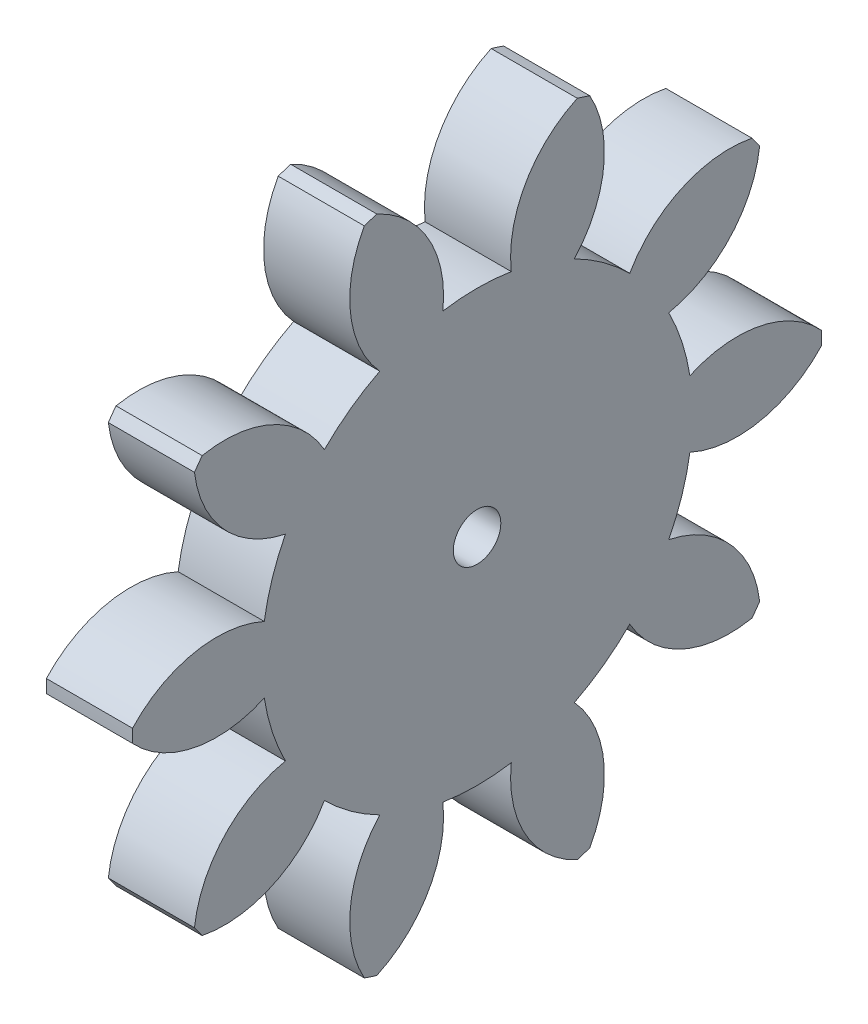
from build123d import *

# Parameters (mm, degrees)
BASPROSKE_W         = 6.35
BASPROSKE_H         = 25.4
TOOTHCUT_DEPTH      = 37.477972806
TEETHCUTS_COUNT     = 10
TEETHCUTS_ANGLE     = 324
BORSKE_R            = 3.175
BORE_DEPTH          = 50.8000508
SKETCH1_R           = 3.175
SKETCH1_R_2         = 1.75
BOSS_EXTRUDE1_DEPTH = 6.35


with BuildPart() as part:
    # BasProSke → Base-Revolve (revolve)
    with BuildSketch(Plane(origin=(0, 0, 0), x_dir=(1, 0, 0), z_dir=(0, 1, 0)), mode=Mode.PRIVATE) as base_revolve_sk:
        with Locations((3.175, 12.7)):
            Rectangle(BASPROSKE_W, BASPROSKE_H)
    revolve(base_revolve_sk.sketch.rotate(Axis((-10, 0, 0), (1, 0, 0)), 180), axis=Axis((-10, 0, 0), (1, 0, 0)))

    # TooCutSke → ToothCut (cut, through all)
    with BuildSketch(Plane(origin=(0, 0, 0), x_dir=(0, 0, -1), z_dir=(1, 0, 0))):
        with BuildLine():
            ThreePointArc((2.521295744, 15.672216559), (0, 15.87373), (-2.521295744, 15.672216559))
            ThreePointArc((-2.521295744, 15.672216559), (-3.569934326, 20.789803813), (-7.422504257, 24.317841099))
            ThreePointArc((-7.422504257, 24.317841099), (0, 25.4254), (7.422504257, 24.317841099))
            ThreePointArc((7.422504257, 24.317841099), (3.569934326, 20.789803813), (2.521295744, 15.672216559))
        make_face()
    toothcut = extrude(amount=TOOTHCUT_DEPTH, mode=Mode.SUBTRACT)

    # TeethCuts: ToothCut ×10 about axis
    teethcuts_axis = Axis((-10, 0, 0), (1, 0, 0))
    for i in range(1, TEETHCUTS_COUNT):
        add(toothcut.rotate(teethcuts_axis, i * TEETHCUTS_ANGLE / (TEETHCUTS_COUNT - 1)), mode=Mode.SUBTRACT)

    # BorSke → Bore (cut, symmetric)
    with BuildSketch(Plane(origin=(0, 0, 0), x_dir=(0, 0, -1), z_dir=(1, 0, 0))):
        with Locations(Location((0, 0, 0), (0, 0, 180))):
            Circle(BORSKE_R)
    extrude(amount=BORE_DEPTH, both=True, mode=Mode.SUBTRACT)

    # Sketch1 → Boss-Extrude1 (add)
    with BuildSketch(Plane(origin=(6.35, 0, 0), x_dir=(0, 0, -1), z_dir=(1, 0, 0))):
        Circle(SKETCH1_R)
        Circle(SKETCH1_R_2, mode=Mode.SUBTRACT)
    extrude(amount=-BOSS_EXTRUDE1_DEPTH)


solid = part.part
